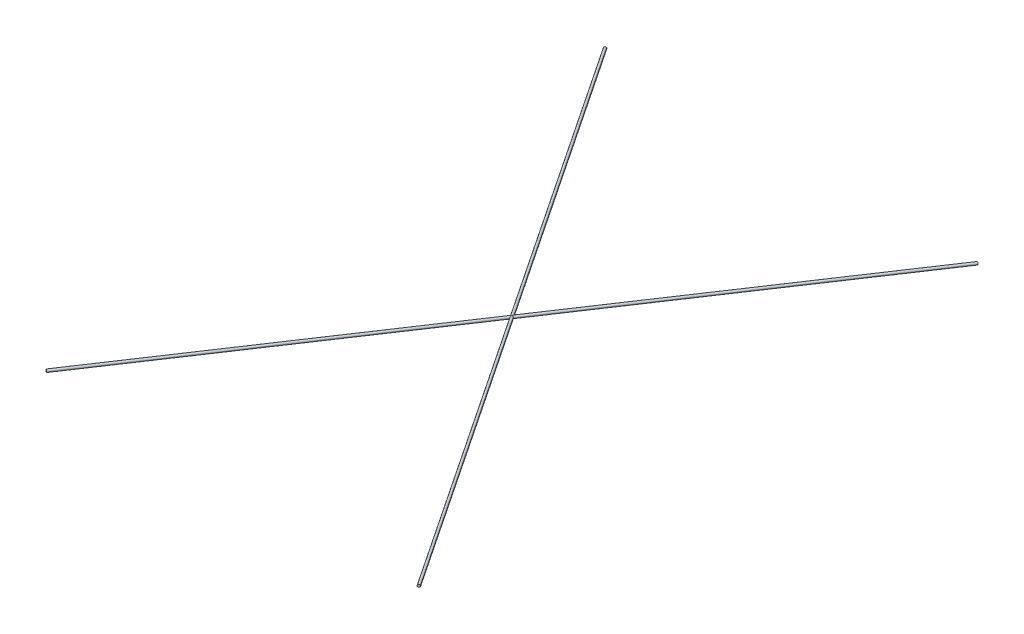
ISO-10303-21;
HEADER;
FILE_DESCRIPTION(('STEP AP214'),'2;1');
FILE_NAME('part.step','',(''),(''),'','','');
FILE_SCHEMA(('AUTOMOTIVE_DESIGN { 1 0 10303 214 1 1 1 1 }'));
ENDSEC;
DATA;
#1=APPLICATION_CONTEXT('core data for automotive mechanical design processes');
#2=APPLICATION_PROTOCOL_DEFINITION('international standard','automotive_design',2000,#1);
#3=PRODUCT_CONTEXT('',#1,'mechanical');
#4=PRODUCT('Part','Part','',(#3));
#5=PRODUCT_RELATED_PRODUCT_CATEGORY('part','',(#4));
#6=PRODUCT_DEFINITION_FORMATION('','',#4);
#7=PRODUCT_DEFINITION_CONTEXT('part definition',#1,'design');
#8=PRODUCT_DEFINITION('design','',#6,#7);
#9=PRODUCT_DEFINITION_SHAPE('','',#8);
#10=(LENGTH_UNIT() NAMED_UNIT(*) SI_UNIT(.MILLI.,.METRE.));
#11=(NAMED_UNIT(*) PLANE_ANGLE_UNIT() SI_UNIT($,.RADIAN.));
#12=(NAMED_UNIT(*) SI_UNIT($,.STERADIAN.) SOLID_ANGLE_UNIT());
#13=UNCERTAINTY_MEASURE_WITH_UNIT(LENGTH_MEASURE(1.E-05),#10,'distance_accuracy_value','');
#14=(GEOMETRIC_REPRESENTATION_CONTEXT(3) GLOBAL_UNCERTAINTY_ASSIGNED_CONTEXT((#13)) GLOBAL_UNIT_ASSIGNED_CONTEXT((#10,
#11,#12)) REPRESENTATION_CONTEXT('',''));
#15=CARTESIAN_POINT('',(0.,0.,0.));
#16=DIRECTION('',(0.,0.,1.));
#17=DIRECTION('',(1.,0.,0.));
#18=AXIS2_PLACEMENT_3D('',#15,#16,#17);
#19=CARTESIAN_POINT('',(722.648270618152,0.,1083.97517388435));
#20=DIRECTION('',(-0.554699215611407,0.,-0.832050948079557));
#21=DIRECTION('',(-0.832050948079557,0.,0.554699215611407));
#22=AXIS2_PLACEMENT_3D('',#19,#20,#21);
#23=PLANE('',#22);
#24=CARTESIAN_POINT('',(722.648270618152,0.,1083.97517388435));
#25=DIRECTION('',(-0.554699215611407,0.,-0.832050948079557));
#26=DIRECTION('',(-0.832050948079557,0.,0.554699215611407));
#27=AXIS2_PLACEMENT_3D('',#24,#25,#26);
#28=CIRCLE('',#27,5.00000000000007);
#29=CARTESIAN_POINT('',(718.488015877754,0.,1086.7486699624));
#30=VERTEX_POINT('',#29);
#31=EDGE_CURVE('E75',#30,#30,#28,.T.);
#32=ORIENTED_EDGE('',*,*,#31,.F.);
#33=EDGE_LOOP('',(#32));
#34=FACE_BOUND('',#33,.T.);
#35=ADVANCED_FACE('F33',(#34),#23,.F.);
#36=CARTESIAN_POINT('',(722.648270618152,0.,1083.97517388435));
#37=DIRECTION('',(-0.554699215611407,0.,-0.832050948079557));
#38=DIRECTION('',(-0.832050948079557,0.,0.554699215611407));
#39=AXIS2_PLACEMENT_3D('',#36,#37,#38);
#40=CYLINDRICAL_SURFACE('',#39,5.00000000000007);
#41=CARTESIAN_POINT('',(3.33066907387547E-13,0.,-2.22044604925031E-13));
#42=DIRECTION('',(0.,0.,-1.));
#43=DIRECTION('',(-1.,0.,0.));
#44=AXIS2_PLACEMENT_3D('',#41,#42,#43);
#45=ELLIPSE('',#44,6.00924740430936,5.00000000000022);
#46=CARTESIAN_POINT('',(3.33066907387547E-13,5.00000000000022,-2.22044604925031E-13));
#47=VERTEX_POINT('',#46);
#48=CARTESIAN_POINT('',(3.33066907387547E-13,-5.00000000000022,-2.22044604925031E-13));
#49=VERTEX_POINT('',#48);
#50=EDGE_CURVE('E40',#47,#49,#45,.T.);
#51=ORIENTED_EDGE('',*,*,#50,.F.);
#52=CARTESIAN_POINT('',(3.33066907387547E-13,0.,-2.22044604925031E-13));
#53=DIRECTION('',(-1.,0.,0.));
#54=DIRECTION('',(0.,0.,-1.));
#55=AXIS2_PLACEMENT_3D('',#52,#53,#54);
#56=ELLIPSE('',#55,9.01389412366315,5.00000000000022);
#57=EDGE_CURVE('E52',#49,#47,#56,.T.);
#58=ORIENTED_EDGE('',*,*,#57,.F.);
#59=EDGE_LOOP('',(#51,#58));
#60=FACE_BOUND('',#59,.T.);
#61=ORIENTED_EDGE('',*,*,#31,.T.);
#62=EDGE_LOOP('',(#61));
#63=FACE_BOUND('',#62,.T.);
#64=ADVANCED_FACE('F53',(#60,#63),#40,.T.);
#65=CARTESIAN_POINT('',(722.64827061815,0.,-1083.97517388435));
#66=DIRECTION('',(0.554699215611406,0.,-0.832050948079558));
#67=DIRECTION('',(-0.832050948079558,0.,-0.554699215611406));
#68=AXIS2_PLACEMENT_3D('',#65,#66,#67);
#69=PLANE('',#68);
#70=CARTESIAN_POINT('',(722.64827061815,0.,-1083.97517388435));
#71=DIRECTION('',(0.554699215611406,0.,-0.832050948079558));
#72=DIRECTION('',(-0.832050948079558,0.,-0.554699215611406));
#73=AXIS2_PLACEMENT_3D('',#70,#71,#72);
#74=CIRCLE('',#73,5.00000000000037);
#75=CARTESIAN_POINT('',(718.488015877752,0.,-1086.7486699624));
#76=VERTEX_POINT('',#75);
#77=EDGE_CURVE('E72',#76,#76,#74,.T.);
#78=ORIENTED_EDGE('',*,*,#77,.T.);
#79=EDGE_LOOP('',(#78));
#80=FACE_BOUND('',#79,.T.);
#81=ADVANCED_FACE('F92',(#80),#69,.T.);
#82=CARTESIAN_POINT('',(-722.648270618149,0.,1083.97517388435));
#83=DIRECTION('',(0.554699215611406,0.,-0.832050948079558));
#84=DIRECTION('',(-0.832050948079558,0.,-0.554699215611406));
#85=AXIS2_PLACEMENT_3D('',#82,#83,#84);
#86=CYLINDRICAL_SURFACE('',#85,5.00000000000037);
#87=ORIENTED_EDGE('',*,*,#77,.F.);
#88=EDGE_LOOP('',(#87));
#89=FACE_BOUND('',#88,.T.);
#90=CARTESIAN_POINT('',(3.33066907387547E-13,0.,-2.22044604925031E-13));
#91=DIRECTION('',(-1.,0.,0.));
#92=DIRECTION('',(0.,0.,-1.));
#93=AXIS2_PLACEMENT_3D('',#90,#91,#92);
#94=ELLIPSE('',#93,9.01389412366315,5.00000000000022);
#95=EDGE_CURVE('E46',#49,#47,#94,.F.);
#96=ORIENTED_EDGE('',*,*,#95,.T.);
#97=ORIENTED_EDGE('',*,*,#50,.T.);
#98=EDGE_LOOP('',(#96,#97));
#99=FACE_BOUND('',#98,.T.);
#100=ADVANCED_FACE('F62',(#89,#99),#86,.T.);
#101=CARTESIAN_POINT('',(-722.64827061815,0.,-1083.97517388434));
#102=DIRECTION('',(-0.554699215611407,0.,-0.832050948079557));
#103=DIRECTION('',(-0.832050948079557,0.,0.554699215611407));
#104=AXIS2_PLACEMENT_3D('',#101,#102,#103);
#105=PLANE('',#104);
#106=CARTESIAN_POINT('',(-722.64827061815,0.,-1083.97517388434));
#107=DIRECTION('',(-0.554699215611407,0.,-0.832050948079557));
#108=DIRECTION('',(-0.832050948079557,0.,0.554699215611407));
#109=AXIS2_PLACEMENT_3D('',#106,#107,#108);
#110=CIRCLE('',#109,5.00000000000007);
#111=CARTESIAN_POINT('',(-726.808525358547,0.,-1081.20167780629));
#112=VERTEX_POINT('',#111);
#113=EDGE_CURVE('E60',#112,#112,#110,.T.);
#114=ORIENTED_EDGE('',*,*,#113,.T.);
#115=EDGE_LOOP('',(#114));
#116=FACE_BOUND('',#115,.T.);
#117=ADVANCED_FACE('F83',(#116),#105,.T.);
#118=CARTESIAN_POINT('',(3.33066907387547E-13,0.,-2.22044604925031E-13));
#119=DIRECTION('',(0.,0.,-1.));
#120=DIRECTION('',(-1.,0.,0.));
#121=AXIS2_PLACEMENT_3D('',#118,#119,#120);
#122=ELLIPSE('',#121,6.00924740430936,5.00000000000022);
#123=EDGE_CURVE('E11',#47,#49,#122,.F.);
#124=ORIENTED_EDGE('',*,*,#123,.F.);
#125=ORIENTED_EDGE('',*,*,#95,.F.);
#126=EDGE_LOOP('',(#124,#125));
#127=FACE_BOUND('',#126,.T.);
#128=ORIENTED_EDGE('',*,*,#113,.F.);
#129=EDGE_LOOP('',(#128));
#130=FACE_BOUND('',#129,.T.);
#131=ADVANCED_FACE('F58',(#127,#130),#40,.T.);
#132=CARTESIAN_POINT('',(-722.648270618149,0.,1083.97517388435));
#133=DIRECTION('',(0.554699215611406,0.,-0.832050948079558));
#134=DIRECTION('',(-0.832050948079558,0.,-0.554699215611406));
#135=AXIS2_PLACEMENT_3D('',#132,#133,#134);
#136=PLANE('',#135);
#137=CARTESIAN_POINT('',(-722.648270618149,0.,1083.97517388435));
#138=DIRECTION('',(0.554699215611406,0.,-0.832050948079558));
#139=DIRECTION('',(-0.832050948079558,0.,-0.554699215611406));
#140=AXIS2_PLACEMENT_3D('',#137,#138,#139);
#141=CIRCLE('',#140,5.00000000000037);
#142=CARTESIAN_POINT('',(-726.808525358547,0.,1081.20167780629));
#143=VERTEX_POINT('',#142);
#144=EDGE_CURVE('E70',#143,#143,#141,.T.);
#145=ORIENTED_EDGE('',*,*,#144,.F.);
#146=EDGE_LOOP('',(#145));
#147=FACE_BOUND('',#146,.T.);
#148=ADVANCED_FACE('F66',(#147),#136,.F.);
#149=ORIENTED_EDGE('',*,*,#57,.T.);
#150=ORIENTED_EDGE('',*,*,#123,.T.);
#151=EDGE_LOOP('',(#149,#150));
#152=FACE_BOUND('',#151,.T.);
#153=ORIENTED_EDGE('',*,*,#144,.T.);
#154=EDGE_LOOP('',(#153));
#155=FACE_BOUND('',#154,.T.);
#156=ADVANCED_FACE('F63',(#152,#155),#86,.T.);
#157=CLOSED_SHELL('',(#35,#64,#81,#100,#117,#131,#148,#156));
#158=MANIFOLD_SOLID_BREP('B2',#157);
#159=ADVANCED_BREP_SHAPE_REPRESENTATION('',(#18,#158),#14);
#160=SHAPE_DEFINITION_REPRESENTATION(#9,#159);
ENDSEC;
END-ISO-10303-21;
